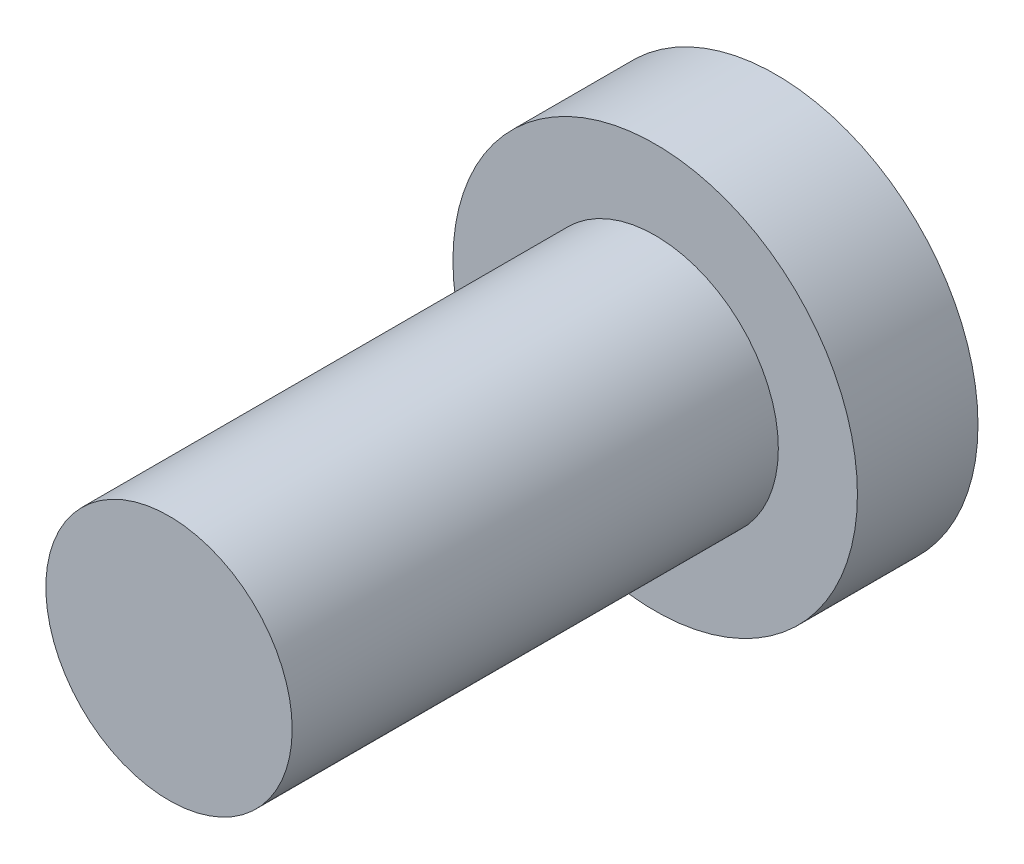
from build123d import *

# Parameters (mm, degrees)
HEX_2_DEPTH = 2.032


with BuildPart() as part:
    # Sketch6 → Revolve1 (revolve)
    with BuildSketch(Plane(origin=(0, 0, 0), x_dir=(0, 0, -1), z_dir=(1, 0, 0)), mode=Mode.PRIVATE) as revolve1_sk:
        Polygon((-9.525, 0), (-9.525, -2.413), (0, -2.413), (0, -3.9624), (2.3622, -3.9624), (2.3622, 0), align=None)
    revolve(revolve1_sk.sketch.rotate(Axis((0, 0, 9.525), (0, 0, -1)), 270), axis=Axis((0, 0, 9.525), (0, 0, -1)))

    # Sketch7 → HEX 2 (cut)
    with BuildSketch(Plane(origin=(0, 0, -2.3622), x_dir=(-1, 0, 0), z_dir=(0, 0, -1))):
        Polygon((-1.1811, 0.681908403), (-1.1811, -0.681908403), (0, -1.363816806), (1.1811, -0.681908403), (1.1811, 0.681908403), (0, 1.363816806), align=None)
    extrude(amount=-HEX_2_DEPTH, mode=Mode.SUBTRACT)


solid = part.part
